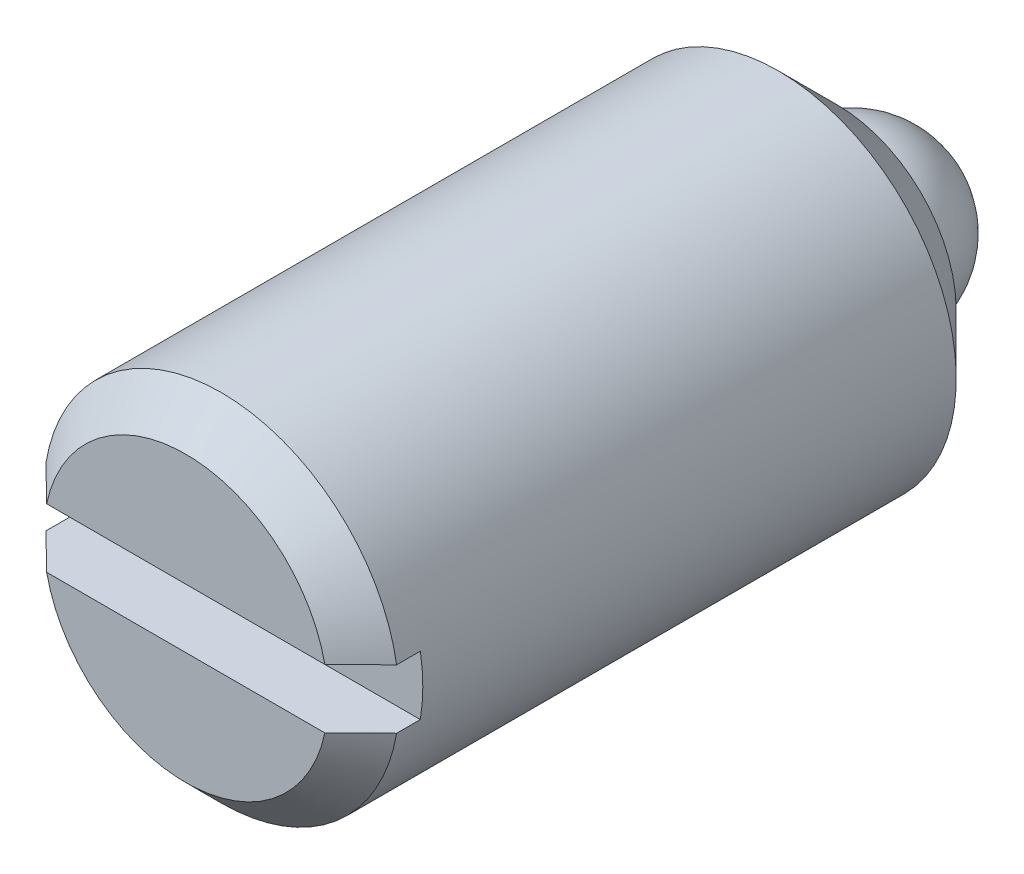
ISO-10303-21;
HEADER;
FILE_DESCRIPTION(('STEP AP214'),'2;1');
FILE_NAME('part.step','',(''),(''),'','','');
FILE_SCHEMA(('AUTOMOTIVE_DESIGN { 1 0 10303 214 1 1 1 1 }'));
ENDSEC;
DATA;
#1=APPLICATION_CONTEXT('core data for automotive mechanical design processes');
#2=APPLICATION_PROTOCOL_DEFINITION('international standard','automotive_design',2000,#1);
#3=PRODUCT_CONTEXT('',#1,'mechanical');
#4=PRODUCT('Part','Part','',(#3));
#5=PRODUCT_RELATED_PRODUCT_CATEGORY('part','',(#4));
#6=PRODUCT_DEFINITION_FORMATION('','',#4);
#7=PRODUCT_DEFINITION_CONTEXT('part definition',#1,'design');
#8=PRODUCT_DEFINITION('design','',#6,#7);
#9=PRODUCT_DEFINITION_SHAPE('','',#8);
#10=(LENGTH_UNIT() NAMED_UNIT(*) SI_UNIT(.MILLI.,.METRE.));
#11=(NAMED_UNIT(*) PLANE_ANGLE_UNIT() SI_UNIT($,.RADIAN.));
#12=(NAMED_UNIT(*) SI_UNIT($,.STERADIAN.) SOLID_ANGLE_UNIT());
#13=UNCERTAINTY_MEASURE_WITH_UNIT(LENGTH_MEASURE(1.E-05),#10,'distance_accuracy_value','');
#14=(GEOMETRIC_REPRESENTATION_CONTEXT(3) GLOBAL_UNCERTAINTY_ASSIGNED_CONTEXT((#13)) GLOBAL_UNIT_ASSIGNED_CONTEXT((#10,
#11,#12)) REPRESENTATION_CONTEXT('',''));
#15=CARTESIAN_POINT('',(0.,0.,0.));
#16=DIRECTION('',(0.,0.,1.));
#17=DIRECTION('',(1.,0.,0.));
#18=AXIS2_PLACEMENT_3D('',#15,#16,#17);
#19=CARTESIAN_POINT('',(0.,6.,25.5));
#20=DIRECTION('',(0.,0.,1.));
#21=DIRECTION('',(1.,0.,0.));
#22=AXIS2_PLACEMENT_3D('',#19,#20,#21);
#23=PLANE('',#22);
#24=DIRECTION('',(1.,0.,0.));
#25=VECTOR('',#24,1.);
#26=CARTESIAN_POINT('',(-5.91607978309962,1.,25.5));
#27=LINE('',#26,#25);
#28=CARTESIAN_POINT('',(-4.69467783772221,1.,25.5));
#29=VERTEX_POINT('',#28);
#30=CARTESIAN_POINT('',(4.69467783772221,1.,25.5));
#31=VERTEX_POINT('',#30);
#32=EDGE_CURVE('E75',#29,#31,#27,.T.);
#33=ORIENTED_EDGE('',*,*,#32,.T.);
#34=CARTESIAN_POINT('',(0.,0.,25.5));
#35=DIRECTION('',(0.,0.,1.));
#36=DIRECTION('',(0.,-1.,0.));
#37=AXIS2_PLACEMENT_3D('',#34,#35,#36);
#38=CIRCLE('',#37,4.8);
#39=EDGE_CURVE('E174',#31,#29,#38,.T.);
#40=ORIENTED_EDGE('',*,*,#39,.T.);
#41=EDGE_LOOP('',(#33,#40));
#42=FACE_BOUND('',#41,.T.);
#43=ADVANCED_FACE('F14',(#42),#23,.T.);
#44=CARTESIAN_POINT('',(0.,0.,-6.5));
#45=DIRECTION('',(0.,0.,-1.));
#46=DIRECTION('',(-1.,0.,0.));
#47=AXIS2_PLACEMENT_3D('',#44,#45,#46);
#48=CYLINDRICAL_SURFACE('',#47,6.);
#49=CARTESIAN_POINT('',(0.,0.,5.5));
#50=DIRECTION('',(0.,0.,-1.));
#51=DIRECTION('',(0.,1.,0.));
#52=AXIS2_PLACEMENT_3D('',#49,#50,#51);
#53=CIRCLE('',#52,6.);
#54=CARTESIAN_POINT('',(0.,6.,5.5));
#55=VERTEX_POINT('',#54);
#56=EDGE_CURVE('E106',#55,#55,#53,.F.);
#57=ORIENTED_EDGE('',*,*,#56,.T.);
#58=EDGE_LOOP('',(#57));
#59=FACE_BOUND('',#58,.T.);
#60=DIRECTION('',(0.,0.,1.));
#61=VECTOR('',#60,1.);
#62=CARTESIAN_POINT('',(-5.91607978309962,1.,23.5));
#63=LINE('',#62,#61);
#64=CARTESIAN_POINT('',(-5.91607978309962,1.,23.5));
#65=VERTEX_POINT('',#64);
#66=CARTESIAN_POINT('',(-5.91607978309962,1.,24.3));
#67=VERTEX_POINT('',#66);
#68=EDGE_CURVE('E95',#65,#67,#63,.T.);
#69=ORIENTED_EDGE('',*,*,#68,.T.);
#70=CARTESIAN_POINT('',(0.,0.,24.3));
#71=DIRECTION('',(0.,0.,1.));
#72=DIRECTION('',(0.,-1.,0.));
#73=AXIS2_PLACEMENT_3D('',#70,#71,#72);
#74=CIRCLE('',#73,6.);
#75=CARTESIAN_POINT('',(5.91607978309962,1.,24.3));
#76=VERTEX_POINT('',#75);
#77=EDGE_CURVE('E110',#67,#76,#74,.F.);
#78=ORIENTED_EDGE('',*,*,#77,.T.);
#79=DIRECTION('',(0.,0.,1.));
#80=VECTOR('',#79,1.);
#81=CARTESIAN_POINT('',(5.91607978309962,1.,23.5));
#82=LINE('',#81,#80);
#83=CARTESIAN_POINT('',(5.91607978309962,1.,23.5));
#84=VERTEX_POINT('',#83);
#85=EDGE_CURVE('E89',#84,#76,#82,.T.);
#86=ORIENTED_EDGE('',*,*,#85,.F.);
#87=CARTESIAN_POINT('',(0.,0.,23.5));
#88=DIRECTION('',(0.,0.,1.));
#89=DIRECTION('',(1.,0.,0.));
#90=AXIS2_PLACEMENT_3D('',#87,#88,#89);
#91=CIRCLE('',#90,6.);
#92=CARTESIAN_POINT('',(5.91607978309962,-1.,23.5));
#93=VERTEX_POINT('',#92);
#94=EDGE_CURVE('E77',#93,#84,#91,.T.);
#95=ORIENTED_EDGE('',*,*,#94,.F.);
#96=DIRECTION('',(0.,0.,1.));
#97=VECTOR('',#96,1.);
#98=CARTESIAN_POINT('',(5.91607978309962,-1.,23.5));
#99=LINE('',#98,#97);
#100=CARTESIAN_POINT('',(5.91607978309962,-1.,24.3));
#101=VERTEX_POINT('',#100);
#102=EDGE_CURVE('E81',#93,#101,#99,.T.);
#103=ORIENTED_EDGE('',*,*,#102,.T.);
#104=CARTESIAN_POINT('',(0.,0.,24.3));
#105=DIRECTION('',(0.,0.,1.));
#106=DIRECTION('',(0.,-1.,0.));
#107=AXIS2_PLACEMENT_3D('',#104,#105,#106);
#108=CIRCLE('',#107,6.);
#109=CARTESIAN_POINT('',(-5.91607978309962,-1.,24.3));
#110=VERTEX_POINT('',#109);
#111=EDGE_CURVE('E87',#101,#110,#108,.F.);
#112=ORIENTED_EDGE('',*,*,#111,.T.);
#113=DIRECTION('',(0.,0.,1.));
#114=VECTOR('',#113,1.);
#115=CARTESIAN_POINT('',(-5.91607978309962,-1.,23.5));
#116=LINE('',#115,#114);
#117=CARTESIAN_POINT('',(-5.91607978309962,-1.,23.5));
#118=VERTEX_POINT('',#117);
#119=EDGE_CURVE('E79',#118,#110,#116,.T.);
#120=ORIENTED_EDGE('',*,*,#119,.F.);
#121=EDGE_CURVE('E65',#65,#118,#91,.T.);
#122=ORIENTED_EDGE('',*,*,#121,.F.);
#123=EDGE_LOOP('',(#69,#78,#86,#95,#103,#112,#120,#122));
#124=FACE_BOUND('',#123,.T.);
#125=ADVANCED_FACE('F85',(#59,#124),#48,.T.);
#126=CARTESIAN_POINT('',(0.,3.,3.5));
#127=DIRECTION('',(0.,0.,-1.));
#128=DIRECTION('',(-1.,0.,0.));
#129=AXIS2_PLACEMENT_3D('',#126,#127,#128);
#130=PLANE('',#129);
#131=CARTESIAN_POINT('',(0.,0.,3.5));
#132=DIRECTION('',(0.,0.,-1.));
#133=DIRECTION('',(0.,1.,0.));
#134=AXIS2_PLACEMENT_3D('',#131,#132,#133);
#135=CIRCLE('',#134,4.);
#136=CARTESIAN_POINT('',(0.,4.,3.5));
#137=VERTEX_POINT('',#136);
#138=EDGE_CURVE('E103',#137,#137,#135,.T.);
#139=ORIENTED_EDGE('',*,*,#138,.T.);
#140=EDGE_LOOP('',(#139));
#141=FACE_BOUND('',#140,.T.);
#142=CARTESIAN_POINT('',(0.,0.,3.5));
#143=DIRECTION('',(0.,0.,-1.));
#144=DIRECTION('',(-1.,0.,0.));
#145=AXIS2_PLACEMENT_3D('',#142,#143,#144);
#146=CIRCLE('',#145,3.);
#147=CARTESIAN_POINT('',(-3.,0.,3.5));
#148=VERTEX_POINT('',#147);
#149=EDGE_CURVE('E100',#148,#148,#146,.T.);
#150=ORIENTED_EDGE('',*,*,#149,.F.);
#151=EDGE_LOOP('',(#150));
#152=FACE_BOUND('',#151,.T.);
#153=ADVANCED_FACE('F140',(#141,#152),#130,.T.);
#154=CARTESIAN_POINT('',(0.,0.,-6.5));
#155=DIRECTION('',(0.,0.,-1.));
#156=DIRECTION('',(-1.,0.,0.));
#157=AXIS2_PLACEMENT_3D('',#154,#155,#156);
#158=CYLINDRICAL_SURFACE('',#157,3.);
#159=CARTESIAN_POINT('',(0.,0.,3.));
#160=DIRECTION('',(0.,0.,-1.));
#161=DIRECTION('',(-1.,0.,0.));
#162=AXIS2_PLACEMENT_3D('',#159,#160,#161);
#163=CIRCLE('',#162,3.);
#164=CARTESIAN_POINT('',(-3.,0.,3.));
#165=VERTEX_POINT('',#164);
#166=EDGE_CURVE('E97',#165,#165,#163,.T.);
#167=ORIENTED_EDGE('',*,*,#166,.F.);
#168=EDGE_LOOP('',(#167));
#169=FACE_BOUND('',#168,.T.);
#170=ORIENTED_EDGE('',*,*,#149,.T.);
#171=EDGE_LOOP('',(#170));
#172=FACE_BOUND('',#171,.T.);
#173=ADVANCED_FACE('F143',(#169,#172),#158,.T.);
#174=CARTESIAN_POINT('',(0.,0.,3.));
#175=DIRECTION('',(-1.,0.,0.));
#176=DIRECTION('',(0.,0.,1.));
#177=AXIS2_PLACEMENT_3D('',#174,#175,#176);
#178=SPHERICAL_SURFACE('',#177,3.);
#179=CARTESIAN_POINT('',(0.,0.,3.));
#180=DIRECTION('',(0.,0.,-1.));
#181=DIRECTION('',(-1.,0.,0.));
#182=AXIS2_PLACEMENT_3D('',#179,#180,#181);
#183=SPHERICAL_SURFACE('',#182,3.);
#184=ORIENTED_EDGE('',*,*,#166,.T.);
#185=EDGE_LOOP('',(#184));
#186=FACE_BOUND('',#185,.T.);
#187=ADVANCED_FACE('F147',(#186),#183,.T.);
#188=DIRECTION('',(1.,0.,0.));
#189=VECTOR('',#188,1.);
#190=CARTESIAN_POINT('',(-5.91607978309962,-1.,25.5));
#191=LINE('',#190,#189);
#192=CARTESIAN_POINT('',(-4.69467783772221,-1.,25.5));
#193=VERTEX_POINT('',#192);
#194=CARTESIAN_POINT('',(4.69467783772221,-1.,25.5));
#195=VERTEX_POINT('',#194);
#196=EDGE_CURVE('E177',#193,#195,#191,.T.);
#197=ORIENTED_EDGE('',*,*,#196,.F.);
#198=CARTESIAN_POINT('',(0.,0.,25.5));
#199=DIRECTION('',(0.,0.,1.));
#200=DIRECTION('',(0.,-1.,0.));
#201=AXIS2_PLACEMENT_3D('',#198,#199,#200);
#202=CIRCLE('',#201,4.8);
#203=EDGE_CURVE('E9',#193,#195,#202,.T.);
#204=ORIENTED_EDGE('',*,*,#203,.T.);
#205=EDGE_LOOP('',(#197,#204));
#206=FACE_BOUND('',#205,.T.);
#207=ADVANCED_FACE('F151',(#206),#23,.T.);
#208=CARTESIAN_POINT('',(-5.91607978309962,1.,23.5));
#209=DIRECTION('',(0.,-1.,0.));
#210=DIRECTION('',(1.,0.,0.));
#211=AXIS2_PLACEMENT_3D('',#208,#209,#210);
#212=PLANE('',#211);
#213=ORIENTED_EDGE('',*,*,#85,.T.);
#214=CARTESIAN_POINT('',(5.91607978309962,1.,24.3));
#215=CARTESIAN_POINT('',(5.81447550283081,1.,24.4001822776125));
#216=CARTESIAN_POINT('',(5.71283625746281,1.,24.5003291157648));
#217=CARTESIAN_POINT('',(5.50947387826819,1.,24.7005373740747));
#218=CARTESIAN_POINT('',(5.40775074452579,1.,24.8005987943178));
#219=CARTESIAN_POINT('',(5.20420639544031,1.,25.00062190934));
#220=CARTESIAN_POINT('',(5.10238518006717,1.,25.1005836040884));
#221=CARTESIAN_POINT('',(4.89862484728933,1.,25.3003869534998));
#222=CARTESIAN_POINT('',(4.79668572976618,1.,25.4002286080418));
#223=CARTESIAN_POINT('',(4.69467783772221,1.,25.5));
#224=B_SPLINE_CURVE_WITH_KNOTS('',3,(#214,#215,#216,#217,#218,#219,#220,#221,#222,#223),
.UNSPECIFIED.,.F.,.F.,(4,2,2,2,4),(0.,0.428064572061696,0.856128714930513,1.28419298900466,
1.71225769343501),.UNSPECIFIED.);
#225=EDGE_CURVE('E120',#76,#31,#224,.T.);
#226=ORIENTED_EDGE('',*,*,#225,.T.);
#227=ORIENTED_EDGE('',*,*,#32,.F.);
#228=CARTESIAN_POINT('',(-4.69467783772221,1.,25.5));
#229=CARTESIAN_POINT('',(-4.79668572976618,1.,25.4002286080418));
#230=CARTESIAN_POINT('',(-4.89862484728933,1.,25.3003869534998));
#231=CARTESIAN_POINT('',(-5.10238518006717,1.,25.1005836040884));
#232=CARTESIAN_POINT('',(-5.20420639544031,1.,25.00062190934));
#233=CARTESIAN_POINT('',(-5.40775074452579,1.,24.8005987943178));
#234=CARTESIAN_POINT('',(-5.50947387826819,1.,24.7005373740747));
#235=CARTESIAN_POINT('',(-5.71283625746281,1.,24.5003291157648));
#236=CARTESIAN_POINT('',(-5.81447550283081,1.,24.4001822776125));
#237=CARTESIAN_POINT('',(-5.91607978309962,1.,24.3));
#238=B_SPLINE_CURVE_WITH_KNOTS('',3,(#228,#229,#230,#231,#232,#233,#234,#235,#236,#237),
.UNSPECIFIED.,.F.,.F.,(4,2,2,2,4),(0.,0.428064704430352,0.8561289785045,1.28419312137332,
1.71225769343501),.UNSPECIFIED.);
#239=EDGE_CURVE('E113',#29,#67,#238,.T.);
#240=ORIENTED_EDGE('',*,*,#239,.T.);
#241=ORIENTED_EDGE('',*,*,#68,.F.);
#242=DIRECTION('',(1.,0.,0.));
#243=VECTOR('',#242,1.);
#244=CARTESIAN_POINT('',(-5.91607978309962,1.,23.5));
#245=LINE('',#244,#243);
#246=EDGE_CURVE('E71',#65,#84,#245,.T.);
#247=ORIENTED_EDGE('',*,*,#246,.T.);
#248=EDGE_LOOP('',(#213,#226,#227,#240,#241,#247));
#249=FACE_BOUND('',#248,.T.);
#250=ADVANCED_FACE('F126',(#249),#212,.T.);
#251=CARTESIAN_POINT('',(-5.91607978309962,-1.,23.5));
#252=DIRECTION('',(0.,-1.,0.));
#253=DIRECTION('',(1.,0.,0.));
#254=AXIS2_PLACEMENT_3D('',#251,#252,#253);
#255=PLANE('',#254);
#256=ORIENTED_EDGE('',*,*,#119,.T.);
#257=CARTESIAN_POINT('',(-5.91607978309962,-1.,24.3));
#258=CARTESIAN_POINT('',(-5.81447550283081,-1.,24.4001822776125));
#259=CARTESIAN_POINT('',(-5.71283625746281,-1.,24.5003291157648));
#260=CARTESIAN_POINT('',(-5.50947387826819,-1.,24.7005373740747));
#261=CARTESIAN_POINT('',(-5.40775074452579,-1.,24.8005987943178));
#262=CARTESIAN_POINT('',(-5.20420639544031,-1.,25.00062190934));
#263=CARTESIAN_POINT('',(-5.10238518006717,-1.,25.1005836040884));
#264=CARTESIAN_POINT('',(-4.89862484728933,-1.,25.3003869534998));
#265=CARTESIAN_POINT('',(-4.79668572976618,-1.,25.4002286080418));
#266=CARTESIAN_POINT('',(-4.69467783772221,-1.,25.5));
#267=B_SPLINE_CURVE_WITH_KNOTS('',3,(#257,#258,#259,#260,#261,#262,#263,#264,#265,#266),
.UNSPECIFIED.,.F.,.F.,(4,2,2,2,4),(0.,0.428064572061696,0.856128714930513,1.28419298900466,
1.71225769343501),.UNSPECIFIED.);
#268=EDGE_CURVE('E23',#110,#193,#267,.T.);
#269=ORIENTED_EDGE('',*,*,#268,.T.);
#270=ORIENTED_EDGE('',*,*,#196,.T.);
#271=CARTESIAN_POINT('',(4.69467783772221,-1.,25.5));
#272=CARTESIAN_POINT('',(4.79668572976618,-1.,25.4002286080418));
#273=CARTESIAN_POINT('',(4.89862484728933,-1.,25.3003869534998));
#274=CARTESIAN_POINT('',(5.10238518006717,-1.,25.1005836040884));
#275=CARTESIAN_POINT('',(5.2042063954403,-1.,25.00062190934));
#276=CARTESIAN_POINT('',(5.40775074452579,-1.,24.8005987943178));
#277=CARTESIAN_POINT('',(5.50947387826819,-1.,24.7005373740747));
#278=CARTESIAN_POINT('',(5.71283625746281,-1.,24.5003291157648));
#279=CARTESIAN_POINT('',(5.81447550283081,-1.,24.4001822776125));
#280=CARTESIAN_POINT('',(5.91607978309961,-1.,24.3));
#281=B_SPLINE_CURVE_WITH_KNOTS('',3,(#271,#272,#273,#274,#275,#276,#277,#278,#279,#280),
.UNSPECIFIED.,.F.,.F.,(4,2,2,2,4),(0.,0.428064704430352,0.856128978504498,1.28419312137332,
1.71225769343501),.UNSPECIFIED.);
#282=EDGE_CURVE('E180',#195,#101,#281,.T.);
#283=ORIENTED_EDGE('',*,*,#282,.T.);
#284=ORIENTED_EDGE('',*,*,#102,.F.);
#285=DIRECTION('',(1.,0.,0.));
#286=VECTOR('',#285,1.);
#287=CARTESIAN_POINT('',(-5.91607978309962,-1.,23.5));
#288=LINE('',#287,#286);
#289=EDGE_CURVE('E68',#118,#93,#288,.T.);
#290=ORIENTED_EDGE('',*,*,#289,.F.);
#291=EDGE_LOOP('',(#256,#269,#270,#283,#284,#290));
#292=FACE_BOUND('',#291,.T.);
#293=ADVANCED_FACE('F78',(#292),#255,.F.);
#294=CARTESIAN_POINT('',(0.,0.,23.5));
#295=DIRECTION('',(0.,0.,1.));
#296=DIRECTION('',(1.,0.,0.));
#297=AXIS2_PLACEMENT_3D('',#294,#295,#296);
#298=PLANE('',#297);
#299=ORIENTED_EDGE('',*,*,#121,.T.);
#300=ORIENTED_EDGE('',*,*,#289,.T.);
#301=ORIENTED_EDGE('',*,*,#94,.T.);
#302=ORIENTED_EDGE('',*,*,#246,.F.);
#303=EDGE_LOOP('',(#299,#300,#301,#302));
#304=FACE_BOUND('',#303,.T.);
#305=ADVANCED_FACE('F67',(#304),#298,.T.);
#306=CARTESIAN_POINT('',(0.,0.,3.5));
#307=DIRECTION('',(0.,0.,1.));
#308=DIRECTION('',(0.,-1.,0.));
#309=AXIS2_PLACEMENT_3D('',#306,#307,#308);
#310=CONICAL_SURFACE('',#309,4.,0.785398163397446);
#311=ORIENTED_EDGE('',*,*,#56,.F.);
#312=EDGE_LOOP('',(#311));
#313=FACE_BOUND('',#312,.T.);
#314=ORIENTED_EDGE('',*,*,#138,.F.);
#315=EDGE_LOOP('',(#314));
#316=FACE_BOUND('',#315,.T.);
#317=ADVANCED_FACE('F134',(#313,#316),#310,.T.);
#318=CARTESIAN_POINT('',(0.,0.,24.3));
#319=DIRECTION('',(0.,0.,-1.));
#320=DIRECTION('',(0.,1.,0.));
#321=AXIS2_PLACEMENT_3D('',#318,#319,#320);
#322=CONICAL_SURFACE('',#321,6.,0.785398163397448);
#323=ORIENTED_EDGE('',*,*,#239,.F.);
#324=ORIENTED_EDGE('',*,*,#39,.F.);
#325=ORIENTED_EDGE('',*,*,#225,.F.);
#326=ORIENTED_EDGE('',*,*,#77,.F.);
#327=EDGE_LOOP('',(#323,#324,#325,#326));
#328=FACE_BOUND('',#327,.T.);
#329=ADVANCED_FACE('F130',(#328),#322,.T.);
#330=CARTESIAN_POINT('',(0.,0.,24.3));
#331=DIRECTION('',(0.,0.,-1.));
#332=DIRECTION('',(0.,1.,0.));
#333=AXIS2_PLACEMENT_3D('',#330,#331,#332);
#334=CONICAL_SURFACE('',#333,6.,0.785398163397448);
#335=ORIENTED_EDGE('',*,*,#282,.F.);
#336=ORIENTED_EDGE('',*,*,#203,.F.);
#337=ORIENTED_EDGE('',*,*,#268,.F.);
#338=ORIENTED_EDGE('',*,*,#111,.F.);
#339=EDGE_LOOP('',(#335,#336,#337,#338));
#340=FACE_BOUND('',#339,.T.);
#341=ADVANCED_FACE('F16',(#340),#334,.T.);
#342=CLOSED_SHELL('',(#43,#125,#153,#173,#187,#207,#250,#293,#305,#317,#329,#341));
#343=MANIFOLD_SOLID_BREP('B1',#342);
#344=ADVANCED_BREP_SHAPE_REPRESENTATION('',(#18,#343),#14);
#345=SHAPE_DEFINITION_REPRESENTATION(#9,#344);
ENDSEC;
END-ISO-10303-21;
